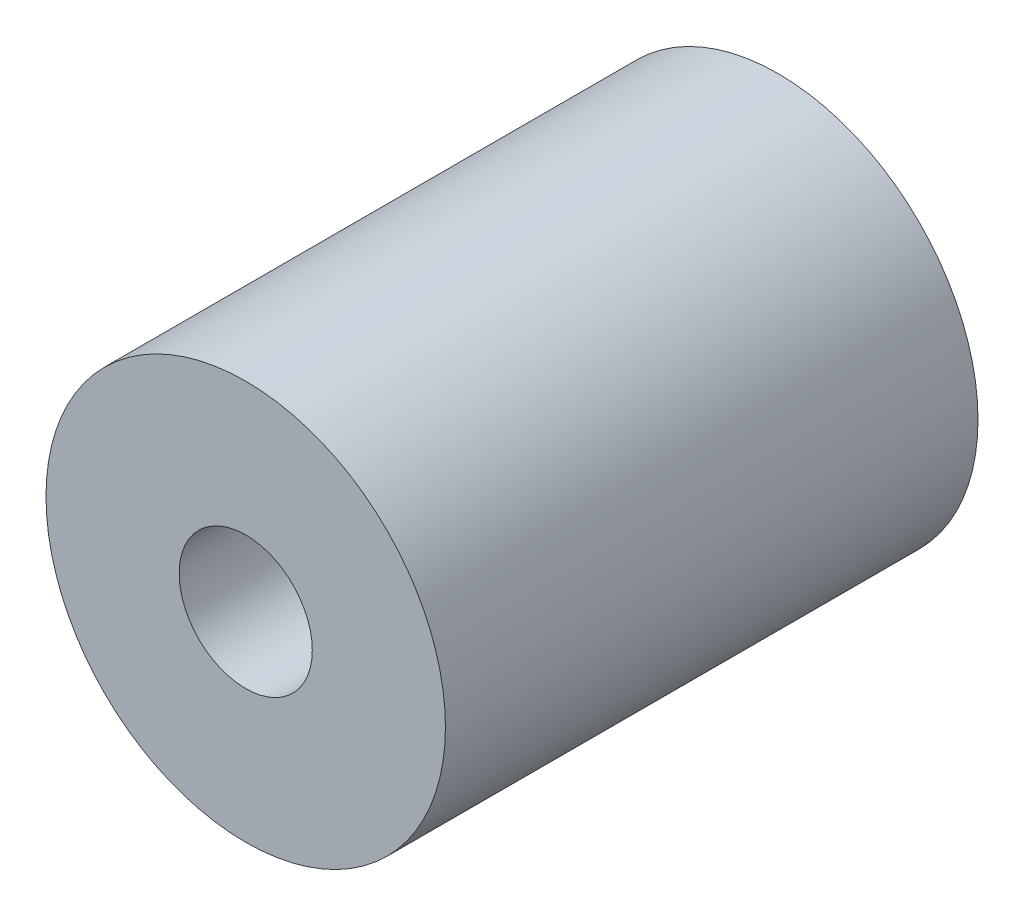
ISO-10303-21;
HEADER;
FILE_DESCRIPTION(('STEP AP214'),'2;1');
FILE_NAME('part.step','',(''),(''),'','','');
FILE_SCHEMA(('AUTOMOTIVE_DESIGN { 1 0 10303 214 1 1 1 1 }'));
ENDSEC;
DATA;
#1=APPLICATION_CONTEXT('core data for automotive mechanical design processes');
#2=APPLICATION_PROTOCOL_DEFINITION('international standard','automotive_design',2000,#1);
#3=PRODUCT_CONTEXT('',#1,'mechanical');
#4=PRODUCT('Part','Part','',(#3));
#5=PRODUCT_RELATED_PRODUCT_CATEGORY('part','',(#4));
#6=PRODUCT_DEFINITION_FORMATION('','',#4);
#7=PRODUCT_DEFINITION_CONTEXT('part definition',#1,'design');
#8=PRODUCT_DEFINITION('design','',#6,#7);
#9=PRODUCT_DEFINITION_SHAPE('','',#8);
#10=(LENGTH_UNIT() NAMED_UNIT(*) SI_UNIT(.MILLI.,.METRE.));
#11=(NAMED_UNIT(*) PLANE_ANGLE_UNIT() SI_UNIT($,.RADIAN.));
#12=(NAMED_UNIT(*) SI_UNIT($,.STERADIAN.) SOLID_ANGLE_UNIT());
#13=UNCERTAINTY_MEASURE_WITH_UNIT(LENGTH_MEASURE(1.E-05),#10,'distance_accuracy_value','');
#14=(GEOMETRIC_REPRESENTATION_CONTEXT(3) GLOBAL_UNCERTAINTY_ASSIGNED_CONTEXT((#13)) GLOBAL_UNIT_ASSIGNED_CONTEXT((#10,
#11,#12)) REPRESENTATION_CONTEXT('',''));
#15=CARTESIAN_POINT('',(0.,0.,0.));
#16=DIRECTION('',(0.,0.,1.));
#17=DIRECTION('',(1.,0.,0.));
#18=AXIS2_PLACEMENT_3D('',#15,#16,#17);
#19=CARTESIAN_POINT('',(0.,0.,4.));
#20=DIRECTION('',(0.,0.,-1.));
#21=DIRECTION('',(-1.,0.,0.));
#22=AXIS2_PLACEMENT_3D('',#19,#20,#21);
#23=CYLINDRICAL_SURFACE('',#22,3.);
#24=CARTESIAN_POINT('',(0.,0.,4.));
#25=DIRECTION('',(0.,0.,1.));
#26=DIRECTION('',(1.,0.,0.));
#27=AXIS2_PLACEMENT_3D('',#24,#25,#26);
#28=CIRCLE('',#27,3.);
#29=CARTESIAN_POINT('',(3.,0.,4.));
#30=VERTEX_POINT('',#29);
#31=EDGE_CURVE('E10',#30,#30,#28,.T.);
#32=ORIENTED_EDGE('',*,*,#31,.F.);
#33=EDGE_LOOP('',(#32));
#34=FACE_BOUND('',#33,.T.);
#35=CARTESIAN_POINT('',(0.,0.,-4.));
#36=DIRECTION('',(0.,0.,1.));
#37=DIRECTION('',(1.,0.,0.));
#38=AXIS2_PLACEMENT_3D('',#35,#36,#37);
#39=CIRCLE('',#38,3.);
#40=CARTESIAN_POINT('',(3.,0.,-4.));
#41=VERTEX_POINT('',#40);
#42=EDGE_CURVE('E33',#41,#41,#39,.T.);
#43=ORIENTED_EDGE('',*,*,#42,.T.);
#44=EDGE_LOOP('',(#43));
#45=FACE_BOUND('',#44,.T.);
#46=ADVANCED_FACE('F30',(#34,#45),#23,.T.);
#47=CARTESIAN_POINT('',(0.,0.,4.));
#48=DIRECTION('',(0.,0.,1.));
#49=DIRECTION('',(1.,0.,0.));
#50=AXIS2_PLACEMENT_3D('',#47,#48,#49);
#51=PLANE('',#50);
#52=CARTESIAN_POINT('',(0.,0.,4.));
#53=DIRECTION('',(0.,0.,1.));
#54=DIRECTION('',(1.,0.,0.));
#55=AXIS2_PLACEMENT_3D('',#52,#53,#54);
#56=CIRCLE('',#55,1.);
#57=CARTESIAN_POINT('',(1.,0.,4.));
#58=VERTEX_POINT('',#57);
#59=EDGE_CURVE('E44',#58,#58,#56,.T.);
#60=ORIENTED_EDGE('',*,*,#59,.F.);
#61=EDGE_LOOP('',(#60));
#62=FACE_BOUND('',#61,.T.);
#63=ORIENTED_EDGE('',*,*,#31,.T.);
#64=EDGE_LOOP('',(#63));
#65=FACE_BOUND('',#64,.T.);
#66=ADVANCED_FACE('F50',(#62,#65),#51,.T.);
#67=CARTESIAN_POINT('',(0.,0.,-4.));
#68=DIRECTION('',(0.,0.,1.));
#69=DIRECTION('',(1.,0.,0.));
#70=AXIS2_PLACEMENT_3D('',#67,#68,#69);
#71=PLANE('',#70);
#72=CARTESIAN_POINT('',(0.,0.,-4.));
#73=DIRECTION('',(0.,0.,1.));
#74=DIRECTION('',(1.,0.,0.));
#75=AXIS2_PLACEMENT_3D('',#72,#73,#74);
#76=CIRCLE('',#75,1.);
#77=CARTESIAN_POINT('',(1.,0.,-4.));
#78=VERTEX_POINT('',#77);
#79=EDGE_CURVE('E40',#78,#78,#76,.T.);
#80=ORIENTED_EDGE('',*,*,#79,.T.);
#81=EDGE_LOOP('',(#80));
#82=FACE_BOUND('',#81,.T.);
#83=ORIENTED_EDGE('',*,*,#42,.F.);
#84=EDGE_LOOP('',(#83));
#85=FACE_BOUND('',#84,.T.);
#86=ADVANCED_FACE('F52',(#82,#85),#71,.F.);
#87=CARTESIAN_POINT('',(0.,0.,-4.));
#88=DIRECTION('',(0.,0.,1.));
#89=DIRECTION('',(1.,0.,0.));
#90=AXIS2_PLACEMENT_3D('',#87,#88,#89);
#91=CYLINDRICAL_SURFACE('',#90,1.);
#92=ORIENTED_EDGE('',*,*,#79,.F.);
#93=EDGE_LOOP('',(#92));
#94=FACE_BOUND('',#93,.T.);
#95=ORIENTED_EDGE('',*,*,#59,.T.);
#96=EDGE_LOOP('',(#95));
#97=FACE_BOUND('',#96,.T.);
#98=ADVANCED_FACE('F48',(#94,#97),#91,.F.);
#99=CLOSED_SHELL('',(#46,#66,#86,#98));
#100=MANIFOLD_SOLID_BREP('B2',#99);
#101=ADVANCED_BREP_SHAPE_REPRESENTATION('',(#18,#100),#14);
#102=SHAPE_DEFINITION_REPRESENTATION(#9,#101);
ENDSEC;
END-ISO-10303-21;
